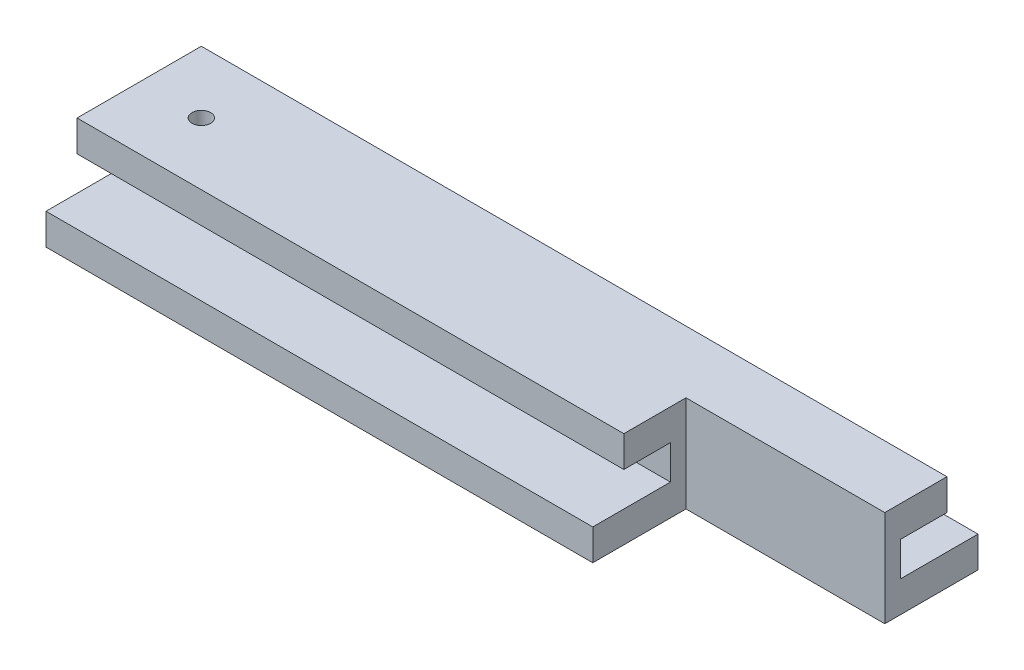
ISO-10303-21;
HEADER;
FILE_DESCRIPTION(('STEP AP214'),'2;1');
FILE_NAME('part.step','',(''),(''),'','','');
FILE_SCHEMA(('AUTOMOTIVE_DESIGN { 1 0 10303 214 1 1 1 1 }'));
ENDSEC;
DATA;
#1=APPLICATION_CONTEXT('core data for automotive mechanical design processes');
#2=APPLICATION_PROTOCOL_DEFINITION('international standard','automotive_design',2000,#1);
#3=PRODUCT_CONTEXT('',#1,'mechanical');
#4=PRODUCT('Part','Part','',(#3));
#5=PRODUCT_RELATED_PRODUCT_CATEGORY('part','',(#4));
#6=PRODUCT_DEFINITION_FORMATION('','',#4);
#7=PRODUCT_DEFINITION_CONTEXT('part definition',#1,'design');
#8=PRODUCT_DEFINITION('design','',#6,#7);
#9=PRODUCT_DEFINITION_SHAPE('','',#8);
#10=(LENGTH_UNIT() NAMED_UNIT(*) SI_UNIT(.MILLI.,.METRE.));
#11=(NAMED_UNIT(*) PLANE_ANGLE_UNIT() SI_UNIT($,.RADIAN.));
#12=(NAMED_UNIT(*) SI_UNIT($,.STERADIAN.) SOLID_ANGLE_UNIT());
#13=UNCERTAINTY_MEASURE_WITH_UNIT(LENGTH_MEASURE(1.E-05),#10,'distance_accuracy_value','');
#14=(GEOMETRIC_REPRESENTATION_CONTEXT(3) GLOBAL_UNCERTAINTY_ASSIGNED_CONTEXT((#13)) GLOBAL_UNIT_ASSIGNED_CONTEXT((#10,
#11,#12)) REPRESENTATION_CONTEXT('',''));
#15=CARTESIAN_POINT('',(0.,0.,0.));
#16=DIRECTION('',(0.,0.,1.));
#17=DIRECTION('',(1.,0.,0.));
#18=AXIS2_PLACEMENT_3D('',#15,#16,#17);
#19=CARTESIAN_POINT('',(120.,-2.5,15.));
#20=DIRECTION('',(0.,1.,0.));
#21=DIRECTION('',(0.,0.,1.));
#22=AXIS2_PLACEMENT_3D('',#19,#20,#21);
#23=PLANE('',#22);
#24=CARTESIAN_POINT('',(10.,-2.5,0.));
#25=DIRECTION('',(0.,1.,0.));
#26=DIRECTION('',(0.,0.,1.));
#27=AXIS2_PLACEMENT_3D('',#24,#25,#26);
#28=CIRCLE('',#27,1.5);
#29=CARTESIAN_POINT('',(10.,-2.5,1.5));
#30=VERTEX_POINT('',#29);
#31=EDGE_CURVE('E175',#30,#30,#28,.T.);
#32=ORIENTED_EDGE('',*,*,#31,.T.);
#33=EDGE_LOOP('',(#32));
#34=FACE_BOUND('',#33,.T.);
#35=DIRECTION('',(-1.,0.,0.));
#36=VECTOR('',#35,1.);
#37=CARTESIAN_POINT('',(120.,-2.5,0.));
#38=LINE('',#37,#36);
#39=CARTESIAN_POINT('',(120.,-2.5,0.));
#40=VERTEX_POINT('',#39);
#41=CARTESIAN_POINT('',(88.,-2.5,0.));
#42=VERTEX_POINT('',#41);
#43=EDGE_CURVE('E172',#40,#42,#38,.T.);
#44=ORIENTED_EDGE('',*,*,#43,.T.);
#45=DIRECTION('',(0.,0.,-1.));
#46=VECTOR('',#45,1.);
#47=CARTESIAN_POINT('',(88.,-2.5,15.));
#48=LINE('',#47,#46);
#49=CARTESIAN_POINT('',(88.,-2.5,15.));
#50=VERTEX_POINT('',#49);
#51=EDGE_CURVE('E153',#50,#42,#48,.T.);
#52=ORIENTED_EDGE('',*,*,#51,.F.);
#53=DIRECTION('',(-1.,0.,0.));
#54=VECTOR('',#53,1.);
#55=CARTESIAN_POINT('',(120.,-2.5,15.));
#56=LINE('',#55,#54);
#57=CARTESIAN_POINT('',(0.,-2.5,15.));
#58=VERTEX_POINT('',#57);
#59=EDGE_CURVE('E282',#50,#58,#56,.T.);
#60=ORIENTED_EDGE('',*,*,#59,.T.);
#61=DIRECTION('',(0.,0.,-1.));
#62=VECTOR('',#61,1.);
#63=CARTESIAN_POINT('',(0.,-2.5,15.));
#64=LINE('',#63,#62);
#65=CARTESIAN_POINT('',(0.,-2.5,-15.));
#66=VERTEX_POINT('',#65);
#67=EDGE_CURVE('E274',#58,#66,#64,.T.);
#68=ORIENTED_EDGE('',*,*,#67,.T.);
#69=DIRECTION('',(-1.,0.,0.));
#70=VECTOR('',#69,1.);
#71=CARTESIAN_POINT('',(120.,-2.5,-15.));
#72=LINE('',#71,#70);
#73=CARTESIAN_POINT('',(120.,-2.5,-15.));
#74=VERTEX_POINT('',#73);
#75=EDGE_CURVE('E285',#74,#66,#72,.T.);
#76=ORIENTED_EDGE('',*,*,#75,.F.);
#77=DIRECTION('',(0.,0.,-1.));
#78=VECTOR('',#77,1.);
#79=CARTESIAN_POINT('',(120.,-2.5,15.));
#80=LINE('',#79,#78);
#81=EDGE_CURVE('E262',#40,#74,#80,.T.);
#82=ORIENTED_EDGE('',*,*,#81,.F.);
#83=EDGE_LOOP('',(#44,#52,#60,#68,#76,#82));
#84=FACE_BOUND('',#83,.T.);
#85=ADVANCED_FACE('F43',(#34,#84),#23,.F.);
#86=CARTESIAN_POINT('',(120.,0.,0.));
#87=DIRECTION('',(1.,0.,0.));
#88=DIRECTION('',(0.,0.,-1.));
#89=AXIS2_PLACEMENT_3D('',#86,#87,#88);
#90=PLANE('',#89);
#91=DIRECTION('',(0.,0.,-1.));
#92=VECTOR('',#91,1.);
#93=CARTESIAN_POINT('',(120.,13.,2.5));
#94=LINE('',#93,#92);
#95=CARTESIAN_POINT('',(120.,13.,0.));
#96=VERTEX_POINT('',#95);
#97=CARTESIAN_POINT('',(120.,13.,-10.));
#98=VERTEX_POINT('',#97);
#99=EDGE_CURVE('E231',#96,#98,#94,.T.);
#100=ORIENTED_EDGE('',*,*,#99,.F.);
#101=DIRECTION('',(0.,-1.,0.));
#102=VECTOR('',#101,1.);
#103=CARTESIAN_POINT('',(120.,13.,0.));
#104=LINE('',#103,#102);
#105=EDGE_CURVE('E149',#96,#40,#104,.T.);
#106=ORIENTED_EDGE('',*,*,#105,.T.);
#107=ORIENTED_EDGE('',*,*,#81,.T.);
#108=DIRECTION('',(0.,1.,0.));
#109=VECTOR('',#108,1.);
#110=CARTESIAN_POINT('',(120.,-2.5,-15.));
#111=LINE('',#110,#109);
#112=CARTESIAN_POINT('',(120.,2.5,-15.));
#113=VERTEX_POINT('',#112);
#114=EDGE_CURVE('E257',#74,#113,#111,.T.);
#115=ORIENTED_EDGE('',*,*,#114,.T.);
#116=DIRECTION('',(0.,0.,-1.));
#117=VECTOR('',#116,1.);
#118=CARTESIAN_POINT('',(120.,2.5,15.));
#119=LINE('',#118,#117);
#120=CARTESIAN_POINT('',(120.,2.5,-2.49999999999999));
#121=VERTEX_POINT('',#120);
#122=EDGE_CURVE('E254',#121,#113,#119,.T.);
#123=ORIENTED_EDGE('',*,*,#122,.F.);
#124=DIRECTION('',(0.,-1.,0.));
#125=VECTOR('',#124,1.);
#126=CARTESIAN_POINT('',(120.,13.,-2.5));
#127=LINE('',#126,#125);
#128=CARTESIAN_POINT('',(120.,8.,-2.5));
#129=VERTEX_POINT('',#128);
#130=EDGE_CURVE('E238',#129,#121,#127,.T.);
#131=ORIENTED_EDGE('',*,*,#130,.F.);
#132=DIRECTION('',(0.,0.,1.));
#133=VECTOR('',#132,1.);
#134=CARTESIAN_POINT('',(120.,8.,-10.));
#135=LINE('',#134,#133);
#136=CARTESIAN_POINT('',(120.,8.,-10.));
#137=VERTEX_POINT('',#136);
#138=EDGE_CURVE('E204',#137,#129,#135,.T.);
#139=ORIENTED_EDGE('',*,*,#138,.F.);
#140=DIRECTION('',(0.,-1.,0.));
#141=VECTOR('',#140,1.);
#142=CARTESIAN_POINT('',(120.,13.,-10.));
#143=LINE('',#142,#141);
#144=EDGE_CURVE('E201',#98,#137,#143,.T.);
#145=ORIENTED_EDGE('',*,*,#144,.F.);
#146=EDGE_LOOP('',(#100,#106,#107,#115,#123,#131,#139,#145));
#147=FACE_BOUND('',#146,.T.);
#148=ADVANCED_FACE('F309',(#147),#90,.T.);
#149=CARTESIAN_POINT('',(0.,13.,0.));
#150=DIRECTION('',(0.,1.,0.));
#151=DIRECTION('',(0.,0.,1.));
#152=AXIS2_PLACEMENT_3D('',#149,#150,#151);
#153=PLANE('',#152);
#154=CARTESIAN_POINT('',(10.,13.,0.));
#155=DIRECTION('',(0.,1.,0.));
#156=DIRECTION('',(0.,0.,1.));
#157=AXIS2_PLACEMENT_3D('',#154,#155,#156);
#158=CIRCLE('',#157,1.5);
#159=CARTESIAN_POINT('',(10.,13.,1.5));
#160=VERTEX_POINT('',#159);
#161=EDGE_CURVE('E381',#160,#160,#158,.T.);
#162=ORIENTED_EDGE('',*,*,#161,.F.);
#163=EDGE_LOOP('',(#162));
#164=FACE_BOUND('',#163,.T.);
#165=DIRECTION('',(0.,0.,-1.));
#166=VECTOR('',#165,1.);
#167=CARTESIAN_POINT('',(88.,13.,15.));
#168=LINE('',#167,#166);
#169=CARTESIAN_POINT('',(88.,13.,10.));
#170=VERTEX_POINT('',#169);
#171=CARTESIAN_POINT('',(88.,13.,0.));
#172=VERTEX_POINT('',#171);
#173=EDGE_CURVE('E59',#170,#172,#168,.T.);
#174=ORIENTED_EDGE('',*,*,#173,.T.);
#175=DIRECTION('',(-1.,0.,0.));
#176=VECTOR('',#175,1.);
#177=CARTESIAN_POINT('',(120.,13.,0.));
#178=LINE('',#177,#176);
#179=EDGE_CURVE('E144',#96,#172,#178,.T.);
#180=ORIENTED_EDGE('',*,*,#179,.F.);
#181=ORIENTED_EDGE('',*,*,#99,.T.);
#182=DIRECTION('',(-1.,0.,0.));
#183=VECTOR('',#182,1.);
#184=CARTESIAN_POINT('',(120.,13.,-10.));
#185=LINE('',#184,#183);
#186=CARTESIAN_POINT('',(0.,13.,-10.));
#187=VERTEX_POINT('',#186);
#188=EDGE_CURVE('E197',#98,#187,#185,.T.);
#189=ORIENTED_EDGE('',*,*,#188,.T.);
#190=DIRECTION('',(0.,0.,-1.));
#191=VECTOR('',#190,1.);
#192=CARTESIAN_POINT('',(0.,13.,2.5));
#193=LINE('',#192,#191);
#194=CARTESIAN_POINT('',(0.,13.,10.));
#195=VERTEX_POINT('',#194);
#196=EDGE_CURVE('E234',#195,#187,#193,.T.);
#197=ORIENTED_EDGE('',*,*,#196,.F.);
#198=DIRECTION('',(1.,0.,0.));
#199=VECTOR('',#198,1.);
#200=CARTESIAN_POINT('',(0.,13.,10.));
#201=LINE('',#200,#199);
#202=EDGE_CURVE('E165',#195,#170,#201,.T.);
#203=ORIENTED_EDGE('',*,*,#202,.T.);
#204=EDGE_LOOP('',(#174,#180,#181,#189,#197,#203));
#205=FACE_BOUND('',#204,.T.);
#206=ADVANCED_FACE('F163',(#164,#205),#153,.T.);
#207=CARTESIAN_POINT('',(0.,13.,-2.5));
#208=DIRECTION('',(0.,0.,-1.));
#209=DIRECTION('',(-1.,0.,0.));
#210=AXIS2_PLACEMENT_3D('',#207,#208,#209);
#211=PLANE('',#210);
#212=DIRECTION('',(0.,-1.,0.));
#213=VECTOR('',#212,1.);
#214=CARTESIAN_POINT('',(0.,13.,-2.5));
#215=LINE('',#214,#213);
#216=CARTESIAN_POINT('',(0.,8.,-2.5));
#217=VERTEX_POINT('',#216);
#218=CARTESIAN_POINT('',(0.,2.5,-2.49999999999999));
#219=VERTEX_POINT('',#218);
#220=EDGE_CURVE('E245',#217,#219,#215,.T.);
#221=ORIENTED_EDGE('',*,*,#220,.F.);
#222=DIRECTION('',(-1.,0.,0.));
#223=VECTOR('',#222,1.);
#224=CARTESIAN_POINT('',(120.,8.,-2.5));
#225=LINE('',#224,#223);
#226=EDGE_CURVE('E66',#129,#217,#225,.T.);
#227=ORIENTED_EDGE('',*,*,#226,.F.);
#228=ORIENTED_EDGE('',*,*,#130,.T.);
#229=DIRECTION('',(1.,0.,0.));
#230=VECTOR('',#229,1.);
#231=CARTESIAN_POINT('',(0.,2.5,-2.5));
#232=LINE('',#231,#230);
#233=EDGE_CURVE('E230',#219,#121,#232,.T.);
#234=ORIENTED_EDGE('',*,*,#233,.F.);
#235=EDGE_LOOP('',(#221,#227,#228,#234));
#236=FACE_BOUND('',#235,.T.);
#237=ADVANCED_FACE('F307',(#236),#211,.T.);
#238=CARTESIAN_POINT('',(0.,13.,2.5));
#239=DIRECTION('',(0.,0.,-1.));
#240=DIRECTION('',(-1.,0.,0.));
#241=AXIS2_PLACEMENT_3D('',#238,#239,#240);
#242=PLANE('',#241);
#243=DIRECTION('',(1.,0.,0.));
#244=VECTOR('',#243,1.);
#245=CARTESIAN_POINT('',(0.,2.5,2.5));
#246=LINE('',#245,#244);
#247=CARTESIAN_POINT('',(0.,2.5,2.50000000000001));
#248=VERTEX_POINT('',#247);
#249=CARTESIAN_POINT('',(88.,2.5,2.5));
#250=VERTEX_POINT('',#249);
#251=EDGE_CURVE('E235',#248,#250,#246,.T.);
#252=ORIENTED_EDGE('',*,*,#251,.T.);
#253=DIRECTION('',(0.,1.,0.));
#254=VECTOR('',#253,1.);
#255=CARTESIAN_POINT('',(88.,13.,2.5));
#256=LINE('',#255,#254);
#257=CARTESIAN_POINT('',(88.,8.,2.5));
#258=VERTEX_POINT('',#257);
#259=EDGE_CURVE('E183',#250,#258,#256,.T.);
#260=ORIENTED_EDGE('',*,*,#259,.T.);
#261=DIRECTION('',(1.,0.,0.));
#262=VECTOR('',#261,1.);
#263=CARTESIAN_POINT('',(0.,8.,2.5));
#264=LINE('',#263,#262);
#265=CARTESIAN_POINT('',(0.,8.,2.5));
#266=VERTEX_POINT('',#265);
#267=EDGE_CURVE('E214',#266,#258,#264,.T.);
#268=ORIENTED_EDGE('',*,*,#267,.F.);
#269=DIRECTION('',(0.,-1.,0.));
#270=VECTOR('',#269,1.);
#271=CARTESIAN_POINT('',(0.,13.,2.5));
#272=LINE('',#271,#270);
#273=EDGE_CURVE('E249',#266,#248,#272,.T.);
#274=ORIENTED_EDGE('',*,*,#273,.T.);
#275=EDGE_LOOP('',(#252,#260,#268,#274));
#276=FACE_BOUND('',#275,.T.);
#277=ADVANCED_FACE('F325',(#276),#242,.F.);
#278=CARTESIAN_POINT('',(120.,2.5,15.));
#279=DIRECTION('',(0.,1.,0.));
#280=DIRECTION('',(0.,0.,1.));
#281=AXIS2_PLACEMENT_3D('',#278,#279,#280);
#282=PLANE('',#281);
#283=DIRECTION('',(0.,0.,-1.));
#284=VECTOR('',#283,1.);
#285=CARTESIAN_POINT('',(0.,2.5,15.));
#286=LINE('',#285,#284);
#287=CARTESIAN_POINT('',(0.,2.5,-15.));
#288=VERTEX_POINT('',#287);
#289=EDGE_CURVE('E248',#219,#288,#286,.T.);
#290=ORIENTED_EDGE('',*,*,#289,.F.);
#291=ORIENTED_EDGE('',*,*,#233,.T.);
#292=ORIENTED_EDGE('',*,*,#122,.T.);
#293=DIRECTION('',(-1.,0.,0.));
#294=VECTOR('',#293,1.);
#295=CARTESIAN_POINT('',(120.,2.5,-15.));
#296=LINE('',#295,#294);
#297=EDGE_CURVE('E265',#113,#288,#296,.T.);
#298=ORIENTED_EDGE('',*,*,#297,.T.);
#299=EDGE_LOOP('',(#290,#291,#292,#298));
#300=FACE_BOUND('',#299,.T.);
#301=ADVANCED_FACE('F293',(#300),#282,.T.);
#302=DIRECTION('',(0.,0.,1.));
#303=VECTOR('',#302,1.);
#304=CARTESIAN_POINT('',(88.,2.5,15.));
#305=LINE('',#304,#303);
#306=CARTESIAN_POINT('',(88.,2.5,15.));
#307=VERTEX_POINT('',#306);
#308=EDGE_CURVE('E187',#250,#307,#305,.T.);
#309=ORIENTED_EDGE('',*,*,#308,.F.);
#310=ORIENTED_EDGE('',*,*,#251,.F.);
#311=CARTESIAN_POINT('',(0.,2.5,15.));
#312=VERTEX_POINT('',#311);
#313=EDGE_CURVE('E266',#312,#248,#286,.T.);
#314=ORIENTED_EDGE('',*,*,#313,.F.);
#315=DIRECTION('',(-1.,0.,0.));
#316=VECTOR('',#315,1.);
#317=CARTESIAN_POINT('',(120.,2.5,15.));
#318=LINE('',#317,#316);
#319=EDGE_CURVE('E52',#307,#312,#318,.T.);
#320=ORIENTED_EDGE('',*,*,#319,.F.);
#321=EDGE_LOOP('',(#309,#310,#314,#320));
#322=FACE_BOUND('',#321,.T.);
#323=ADVANCED_FACE('F45',(#322),#282,.T.);
#324=CARTESIAN_POINT('',(120.,-2.5,15.));
#325=DIRECTION('',(0.,0.,1.));
#326=DIRECTION('',(1.,0.,0.));
#327=AXIS2_PLACEMENT_3D('',#324,#325,#326);
#328=PLANE('',#327);
#329=DIRECTION('',(0.,-1.,0.));
#330=VECTOR('',#329,1.);
#331=CARTESIAN_POINT('',(88.,13.,15.));
#332=LINE('',#331,#330);
#333=EDGE_CURVE('E160',#307,#50,#332,.T.);
#334=ORIENTED_EDGE('',*,*,#333,.F.);
#335=ORIENTED_EDGE('',*,*,#319,.T.);
#336=DIRECTION('',(0.,1.,0.));
#337=VECTOR('',#336,1.);
#338=CARTESIAN_POINT('',(0.,-2.5,15.));
#339=LINE('',#338,#337);
#340=EDGE_CURVE('E258',#58,#312,#339,.T.);
#341=ORIENTED_EDGE('',*,*,#340,.F.);
#342=ORIENTED_EDGE('',*,*,#59,.F.);
#343=EDGE_LOOP('',(#334,#335,#341,#342));
#344=FACE_BOUND('',#343,.T.);
#345=ADVANCED_FACE('F316',(#344),#328,.T.);
#346=CARTESIAN_POINT('',(120.,-2.5,-15.));
#347=DIRECTION('',(0.,0.,1.));
#348=DIRECTION('',(1.,0.,0.));
#349=AXIS2_PLACEMENT_3D('',#346,#347,#348);
#350=PLANE('',#349);
#351=DIRECTION('',(0.,1.,0.));
#352=VECTOR('',#351,1.);
#353=CARTESIAN_POINT('',(0.,-2.5,-15.));
#354=LINE('',#353,#352);
#355=EDGE_CURVE('E270',#66,#288,#354,.T.);
#356=ORIENTED_EDGE('',*,*,#355,.T.);
#357=ORIENTED_EDGE('',*,*,#297,.F.);
#358=ORIENTED_EDGE('',*,*,#114,.F.);
#359=ORIENTED_EDGE('',*,*,#75,.T.);
#360=EDGE_LOOP('',(#356,#357,#358,#359));
#361=FACE_BOUND('',#360,.T.);
#362=ADVANCED_FACE('F299',(#361),#350,.F.);
#363=CARTESIAN_POINT('',(0.,0.,0.));
#364=DIRECTION('',(1.,0.,0.));
#365=DIRECTION('',(0.,0.,-1.));
#366=AXIS2_PLACEMENT_3D('',#363,#364,#365);
#367=PLANE('',#366);
#368=ORIENTED_EDGE('',*,*,#313,.T.);
#369=ORIENTED_EDGE('',*,*,#273,.F.);
#370=DIRECTION('',(0.,0.,-1.));
#371=VECTOR('',#370,1.);
#372=CARTESIAN_POINT('',(0.,8.,10.));
#373=LINE('',#372,#371);
#374=CARTESIAN_POINT('',(0.,8.,10.));
#375=VERTEX_POINT('',#374);
#376=EDGE_CURVE('E224',#375,#266,#373,.T.);
#377=ORIENTED_EDGE('',*,*,#376,.F.);
#378=DIRECTION('',(0.,-1.,0.));
#379=VECTOR('',#378,1.);
#380=CARTESIAN_POINT('',(0.,13.,10.));
#381=LINE('',#380,#379);
#382=EDGE_CURVE('E221',#195,#375,#381,.T.);
#383=ORIENTED_EDGE('',*,*,#382,.F.);
#384=ORIENTED_EDGE('',*,*,#196,.T.);
#385=DIRECTION('',(0.,-1.,0.));
#386=VECTOR('',#385,1.);
#387=CARTESIAN_POINT('',(0.,13.,-10.));
#388=LINE('',#387,#386);
#389=CARTESIAN_POINT('',(0.,8.,-10.));
#390=VERTEX_POINT('',#389);
#391=EDGE_CURVE('E193',#187,#390,#388,.T.);
#392=ORIENTED_EDGE('',*,*,#391,.T.);
#393=DIRECTION('',(0.,0.,1.));
#394=VECTOR('',#393,1.);
#395=CARTESIAN_POINT('',(0.,8.,-10.));
#396=LINE('',#395,#394);
#397=EDGE_CURVE('E210',#390,#217,#396,.T.);
#398=ORIENTED_EDGE('',*,*,#397,.T.);
#399=ORIENTED_EDGE('',*,*,#220,.T.);
#400=ORIENTED_EDGE('',*,*,#289,.T.);
#401=ORIENTED_EDGE('',*,*,#355,.F.);
#402=ORIENTED_EDGE('',*,*,#67,.F.);
#403=ORIENTED_EDGE('',*,*,#340,.T.);
#404=EDGE_LOOP('',(#368,#369,#377,#383,#384,#392,#398,#399,#400,#401,#402,#403));
#405=FACE_BOUND('',#404,.T.);
#406=ADVANCED_FACE('F303',(#405),#367,.F.);
#407=CARTESIAN_POINT('',(0.,8.,10.));
#408=DIRECTION('',(0.,1.,0.));
#409=DIRECTION('',(0.,0.,1.));
#410=AXIS2_PLACEMENT_3D('',#407,#408,#409);
#411=PLANE('',#410);
#412=ORIENTED_EDGE('',*,*,#267,.T.);
#413=DIRECTION('',(0.,0.,1.));
#414=VECTOR('',#413,1.);
#415=CARTESIAN_POINT('',(88.,8.,10.));
#416=LINE('',#415,#414);
#417=CARTESIAN_POINT('',(88.,8.,10.));
#418=VERTEX_POINT('',#417);
#419=EDGE_CURVE('E159',#258,#418,#416,.T.);
#420=ORIENTED_EDGE('',*,*,#419,.T.);
#421=DIRECTION('',(1.,0.,0.));
#422=VECTOR('',#421,1.);
#423=CARTESIAN_POINT('',(0.,8.,10.));
#424=LINE('',#423,#422);
#425=EDGE_CURVE('E215',#375,#418,#424,.T.);
#426=ORIENTED_EDGE('',*,*,#425,.F.);
#427=ORIENTED_EDGE('',*,*,#376,.T.);
#428=EDGE_LOOP('',(#412,#420,#426,#427));
#429=FACE_BOUND('',#428,.T.);
#430=ADVANCED_FACE('F328',(#429),#411,.F.);
#431=CARTESIAN_POINT('',(0.,0.,10.));
#432=DIRECTION('',(0.,0.,-1.));
#433=DIRECTION('',(-1.,0.,0.));
#434=AXIS2_PLACEMENT_3D('',#431,#432,#433);
#435=PLANE('',#434);
#436=ORIENTED_EDGE('',*,*,#425,.T.);
#437=DIRECTION('',(0.,1.,0.));
#438=VECTOR('',#437,1.);
#439=CARTESIAN_POINT('',(88.,0.,10.));
#440=LINE('',#439,#438);
#441=EDGE_CURVE('E11',#418,#170,#440,.T.);
#442=ORIENTED_EDGE('',*,*,#441,.T.);
#443=ORIENTED_EDGE('',*,*,#202,.F.);
#444=ORIENTED_EDGE('',*,*,#382,.T.);
#445=EDGE_LOOP('',(#436,#442,#443,#444));
#446=FACE_BOUND('',#445,.T.);
#447=ADVANCED_FACE('F333',(#446),#435,.F.);
#448=CARTESIAN_POINT('',(120.,8.,-10.));
#449=DIRECTION('',(0.,1.,0.));
#450=DIRECTION('',(0.,0.,1.));
#451=AXIS2_PLACEMENT_3D('',#448,#449,#450);
#452=PLANE('',#451);
#453=ORIENTED_EDGE('',*,*,#226,.T.);
#454=ORIENTED_EDGE('',*,*,#397,.F.);
#455=DIRECTION('',(-1.,0.,0.));
#456=VECTOR('',#455,1.);
#457=CARTESIAN_POINT('',(120.,8.,-10.));
#458=LINE('',#457,#456);
#459=EDGE_CURVE('E190',#137,#390,#458,.T.);
#460=ORIENTED_EDGE('',*,*,#459,.F.);
#461=ORIENTED_EDGE('',*,*,#138,.T.);
#462=EDGE_LOOP('',(#453,#454,#460,#461));
#463=FACE_BOUND('',#462,.T.);
#464=ADVANCED_FACE('F335',(#463),#452,.F.);
#465=CARTESIAN_POINT('',(0.,0.,-10.));
#466=DIRECTION('',(0.,0.,1.));
#467=DIRECTION('',(1.,0.,0.));
#468=AXIS2_PLACEMENT_3D('',#465,#466,#467);
#469=PLANE('',#468);
#470=ORIENTED_EDGE('',*,*,#459,.T.);
#471=ORIENTED_EDGE('',*,*,#391,.F.);
#472=ORIENTED_EDGE('',*,*,#188,.F.);
#473=ORIENTED_EDGE('',*,*,#144,.T.);
#474=EDGE_LOOP('',(#470,#471,#472,#473));
#475=FACE_BOUND('',#474,.T.);
#476=ADVANCED_FACE('F341',(#475),#469,.F.);
#477=CARTESIAN_POINT('',(120.,13.,0.));
#478=DIRECTION('',(0.,0.,1.));
#479=DIRECTION('',(1.,0.,0.));
#480=AXIS2_PLACEMENT_3D('',#477,#478,#479);
#481=PLANE('',#480);
#482=ORIENTED_EDGE('',*,*,#43,.F.);
#483=ORIENTED_EDGE('',*,*,#105,.F.);
#484=ORIENTED_EDGE('',*,*,#179,.T.);
#485=DIRECTION('',(0.,-1.,0.));
#486=VECTOR('',#485,1.);
#487=CARTESIAN_POINT('',(88.,13.,0.));
#488=LINE('',#487,#486);
#489=EDGE_CURVE('E146',#172,#42,#488,.T.);
#490=ORIENTED_EDGE('',*,*,#489,.T.);
#491=EDGE_LOOP('',(#482,#483,#484,#490));
#492=FACE_BOUND('',#491,.T.);
#493=ADVANCED_FACE('F145',(#492),#481,.T.);
#494=CARTESIAN_POINT('',(88.,13.,15.));
#495=DIRECTION('',(-1.,0.,0.));
#496=DIRECTION('',(0.,0.,1.));
#497=AXIS2_PLACEMENT_3D('',#494,#495,#496);
#498=PLANE('',#497);
#499=ORIENTED_EDGE('',*,*,#308,.T.);
#500=ORIENTED_EDGE('',*,*,#333,.T.);
#501=ORIENTED_EDGE('',*,*,#51,.T.);
#502=ORIENTED_EDGE('',*,*,#489,.F.);
#503=ORIENTED_EDGE('',*,*,#173,.F.);
#504=ORIENTED_EDGE('',*,*,#441,.F.);
#505=ORIENTED_EDGE('',*,*,#419,.F.);
#506=ORIENTED_EDGE('',*,*,#259,.F.);
#507=EDGE_LOOP('',(#499,#500,#501,#502,#503,#504,#505,#506));
#508=FACE_BOUND('',#507,.T.);
#509=ADVANCED_FACE('F155',(#508),#498,.F.);
#510=CARTESIAN_POINT('',(10.,-2.5,0.));
#511=DIRECTION('',(0.,1.,0.));
#512=DIRECTION('',(0.,0.,1.));
#513=AXIS2_PLACEMENT_3D('',#510,#511,#512);
#514=CYLINDRICAL_SURFACE('',#513,1.5);
#515=ORIENTED_EDGE('',*,*,#31,.F.);
#516=EDGE_LOOP('',(#515));
#517=FACE_BOUND('',#516,.T.);
#518=ORIENTED_EDGE('',*,*,#161,.T.);
#519=EDGE_LOOP('',(#518));
#520=FACE_BOUND('',#519,.T.);
#521=ADVANCED_FACE('F388',(#517,#520),#514,.F.);
#522=CLOSED_SHELL('',(#85,#148,#206,#237,#277,#301,#323,#345,#362,#406,#430,#447,#464,#476,#493,
#509,#521));
#523=MANIFOLD_SOLID_BREP('B2',#522);
#524=ADVANCED_BREP_SHAPE_REPRESENTATION('',(#18,#523),#14);
#525=SHAPE_DEFINITION_REPRESENTATION(#9,#524);
ENDSEC;
END-ISO-10303-21;
